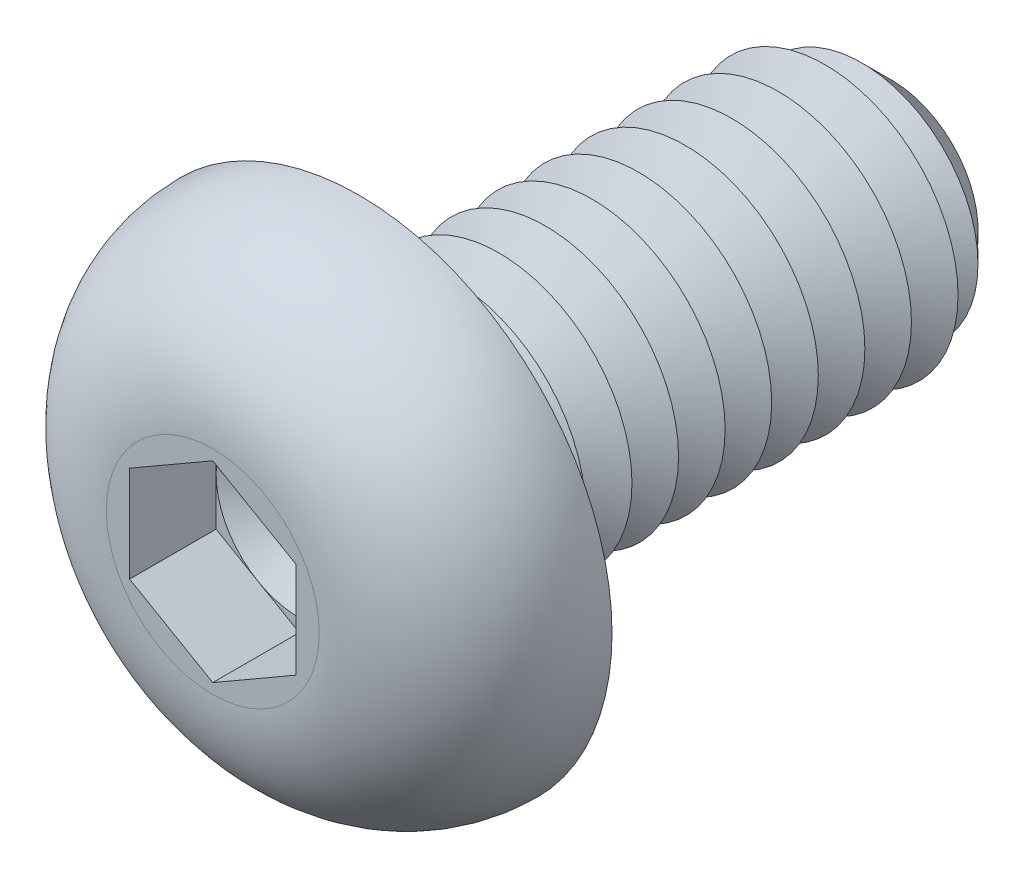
from build123d import *

# Parameters (mm, degrees)
CUT_EXTRUDE1_DEPTH  = 1.3
SKETCH4_R           = 2
BOSS_EXTRUDE1_DEPTH = 8
CHAMFER1_SIZE       = 0.7
LPATTERN1_COUNT     = 10
LPATTERN1_PITCH     = 0.7
FILLET2_R           = 0.3


with BuildPart() as part:
    # Sketch2 → Revolve1 (revolve)
    with BuildSketch(Plane(origin=(0, 0, 0), x_dir=(0, 0, -1), z_dir=(1, 0, 0)), mode=Mode.PRIVATE) as revolve1_sk:
        with BuildLine():
            Line((0, 0), (-2.2, 0))
            Line((-2.2, 0), (-2.2, 1.6))
            ThreePointArc((-2.2, 1.6), (-1.555634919, 3.155634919), (0, 3.8))
            Line((0, 3.8), (0, 0))
        make_face()
    revolve(revolve1_sk.sketch.rotate(Axis((0, 0, 47.934239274), (0, 0, -1)), 90), axis=Axis((0, 0, 47.934239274), (0, 0, -1)))

    # Sketch3 → Cut-Extrude1 (cut)
    with BuildSketch(Plane.XY.offset(2.2)):
        Polygon((0, 1.443375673), (-1.25, 0.721687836), (-1.25, -0.721687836), (0, -1.443375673), (1.25, -0.721687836), (1.25, 0.721687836), align=None)
    extrude(amount=-CUT_EXTRUDE1_DEPTH, mode=Mode.SUBTRACT)

    # Sketch4 → Boss-Extrude1 (add)
    with BuildSketch(Plane(origin=(0, 0, 0), x_dir=(-1, 0, 0), z_dir=(0, 0, -1))):
        with Locations(Location((0, 0, 0), (0, 0, 180))):
            Circle(SKETCH4_R)
    extrude(amount=BOSS_EXTRUDE1_DEPTH)

    # Chamfer1
    chamfer1_edges = [part.edges().sort_by_distance(p)[0] for p in [
        (-2, 0, -8),
    ]]
    chamfer(chamfer1_edges, length=CHAMFER1_SIZE)

    # Sketch5 → Cut-Revolve1 (revolve, cut)
    with BuildSketch(Plane(origin=(0, 0, 0), x_dir=(0, 0, -1), z_dir=(1, 0, 0)), mode=Mode.PRIVATE) as cut_revolve1_sk:
        Polygon((0.7, 2), (1.4, 2), (1.05, 1.393782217), align=None)
    cut_revolve1 = revolve(cut_revolve1_sk.sketch.rotate(Axis((0, 0, 47.934239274), (0, 0, -1)), 90), axis=Axis((0, 0, 47.934239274), (0, 0, -1)), mode=Mode.SUBTRACT)

    # LPattern1: Cut-Revolve1 ×10
    with Locations(*[(0, 0, -i * LPATTERN1_PITCH) for i in range(1, LPATTERN1_COUNT)]):
        add(cut_revolve1, mode=Mode.SUBTRACT)

    # Fillet2
    fillet2_edges = [part.edges().sort_by_distance(p)[0] for p in [
        (-2, 0, 0),
    ]]
    fillet(fillet2_edges, radius=FILLET2_R)

    # Cut-Extrude2 cone 1 section (on through the dimple's axis) → Cut-Extrude2 (revolve, cut)
    with BuildSketch(Plane(origin=(0, 0, 0.9), x_dir=(0, -1, 0), z_dir=(1, 0, 0))):
        Polygon((0, 0), (1.25, 0), (0, 0.721687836), align=None)
    revolve(axis=Axis((0, 0, 0.9), (0, 0, -1)), mode=Mode.SUBTRACT)


solid = part.part
